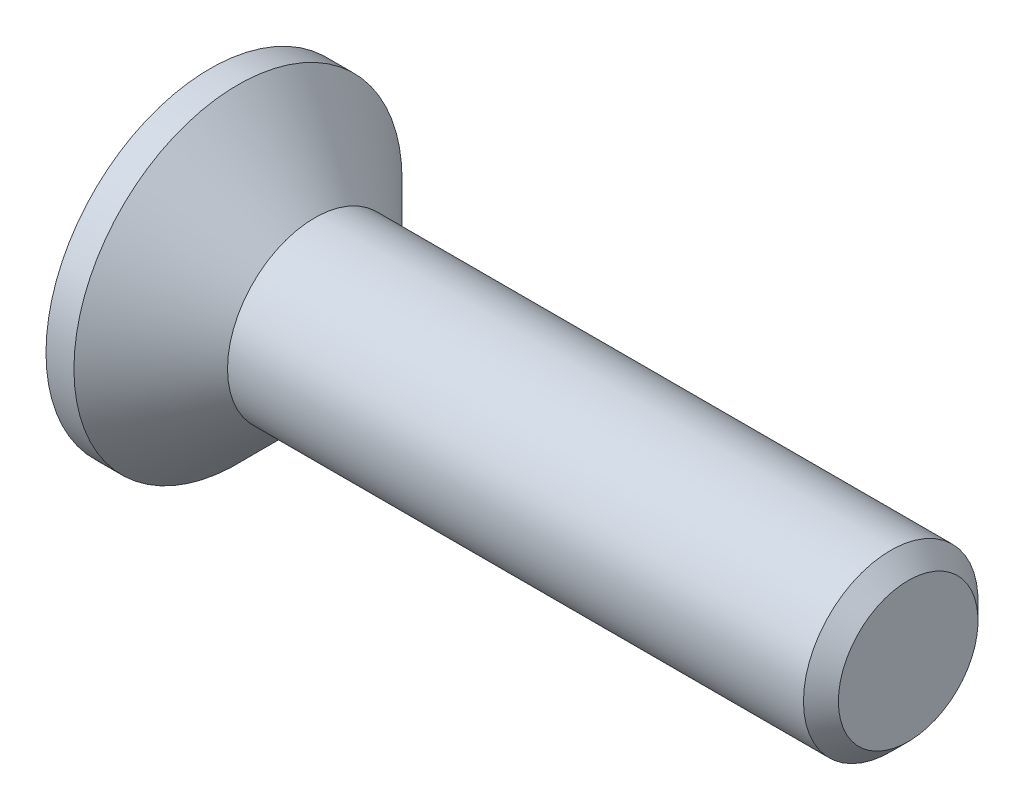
ISO-10303-21;
HEADER;
FILE_DESCRIPTION(('STEP AP214'),'2;1');
FILE_NAME('part.step','',(''),(''),'','','');
FILE_SCHEMA(('AUTOMOTIVE_DESIGN { 1 0 10303 214 1 1 1 1 }'));
ENDSEC;
DATA;
#1=APPLICATION_CONTEXT('core data for automotive mechanical design processes');
#2=APPLICATION_PROTOCOL_DEFINITION('international standard','automotive_design',2000,#1);
#3=PRODUCT_CONTEXT('',#1,'mechanical');
#4=PRODUCT('Part','Part','',(#3));
#5=PRODUCT_RELATED_PRODUCT_CATEGORY('part','',(#4));
#6=PRODUCT_DEFINITION_FORMATION('','',#4);
#7=PRODUCT_DEFINITION_CONTEXT('part definition',#1,'design');
#8=PRODUCT_DEFINITION('design','',#6,#7);
#9=PRODUCT_DEFINITION_SHAPE('','',#8);
#10=(LENGTH_UNIT() NAMED_UNIT(*) SI_UNIT(.MILLI.,.METRE.));
#11=(NAMED_UNIT(*) PLANE_ANGLE_UNIT() SI_UNIT($,.RADIAN.));
#12=(NAMED_UNIT(*) SI_UNIT($,.STERADIAN.) SOLID_ANGLE_UNIT());
#13=UNCERTAINTY_MEASURE_WITH_UNIT(LENGTH_MEASURE(1.E-05),#10,'distance_accuracy_value','');
#14=(GEOMETRIC_REPRESENTATION_CONTEXT(3) GLOBAL_UNCERTAINTY_ASSIGNED_CONTEXT((#13)) GLOBAL_UNIT_ASSIGNED_CONTEXT((#10,
#11,#12)) REPRESENTATION_CONTEXT('',''));
#15=CARTESIAN_POINT('',(0.,0.,0.));
#16=DIRECTION('',(0.,0.,1.));
#17=DIRECTION('',(1.,0.,0.));
#18=AXIS2_PLACEMENT_3D('',#15,#16,#17);
#19=CARTESIAN_POINT('',(0.,0.,0.));
#20=DIRECTION('',(-1.,0.,0.));
#21=DIRECTION('',(0.,0.,1.));
#22=AXIS2_PLACEMENT_3D('',#19,#20,#21);
#23=CONICAL_SURFACE('',#22,1.25,0.78539816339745);
#24=CARTESIAN_POINT('',(-1.1,0.,0.));
#25=DIRECTION('',(-1.,0.,0.));
#26=DIRECTION('',(0.,0.,1.));
#27=AXIS2_PLACEMENT_3D('',#24,#25,#26);
#28=CIRCLE('',#27,2.35);
#29=CARTESIAN_POINT('',(-1.1,0.,2.35));
#30=VERTEX_POINT('',#29);
#31=EDGE_CURVE('E189',#30,#30,#28,.T.);
#32=ORIENTED_EDGE('',*,*,#31,.F.);
#33=EDGE_LOOP('',(#32));
#34=FACE_BOUND('',#33,.T.);
#35=CARTESIAN_POINT('',(0.,0.,0.));
#36=DIRECTION('',(-1.,0.,0.));
#37=DIRECTION('',(0.,0.,1.));
#38=AXIS2_PLACEMENT_3D('',#35,#36,#37);
#39=CIRCLE('',#38,1.25);
#40=CARTESIAN_POINT('',(0.,0.,1.25));
#41=VERTEX_POINT('',#40);
#42=EDGE_CURVE('E212',#41,#41,#39,.T.);
#43=ORIENTED_EDGE('',*,*,#42,.T.);
#44=EDGE_LOOP('',(#43));
#45=FACE_BOUND('',#44,.T.);
#46=ADVANCED_FACE('F33',(#34,#45),#23,.T.);
#47=CARTESIAN_POINT('',(-1.5,0.,0.));
#48=DIRECTION('',(-1.,0.,0.));
#49=DIRECTION('',(0.,0.,1.));
#50=AXIS2_PLACEMENT_3D('',#47,#48,#49);
#51=CYLINDRICAL_SURFACE('',#50,1.25);
#52=CARTESIAN_POINT('',(8.25,0.,0.));
#53=DIRECTION('',(-1.,0.,0.));
#54=DIRECTION('',(0.,0.,1.));
#55=AXIS2_PLACEMENT_3D('',#52,#53,#54);
#56=CIRCLE('',#55,1.25);
#57=CARTESIAN_POINT('',(8.25,0.,1.25));
#58=VERTEX_POINT('',#57);
#59=EDGE_CURVE('E41',#58,#58,#56,.T.);
#60=ORIENTED_EDGE('',*,*,#59,.T.);
#61=EDGE_LOOP('',(#60));
#62=FACE_BOUND('',#61,.T.);
#63=ORIENTED_EDGE('',*,*,#42,.F.);
#64=EDGE_LOOP('',(#63));
#65=FACE_BOUND('',#64,.T.);
#66=ADVANCED_FACE('F217',(#62,#65),#51,.T.);
#67=CARTESIAN_POINT('',(8.5,0.,0.));
#68=DIRECTION('',(-1.,0.,0.));
#69=DIRECTION('',(0.,0.,1.));
#70=AXIS2_PLACEMENT_3D('',#67,#68,#69);
#71=PLANE('',#70);
#72=CARTESIAN_POINT('',(8.5,0.,0.));
#73=DIRECTION('',(-1.,0.,0.));
#74=DIRECTION('',(0.,0.,1.));
#75=AXIS2_PLACEMENT_3D('',#72,#73,#74);
#76=CIRCLE('',#75,0.999999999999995);
#77=CARTESIAN_POINT('',(8.5,0.,0.999999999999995));
#78=VERTEX_POINT('',#77);
#79=EDGE_CURVE('E11',#78,#78,#76,.F.);
#80=ORIENTED_EDGE('',*,*,#79,.T.);
#81=EDGE_LOOP('',(#80));
#82=FACE_BOUND('',#81,.T.);
#83=ADVANCED_FACE('F239',(#82),#71,.F.);
#84=CARTESIAN_POINT('',(-1.5,2.35,0.));
#85=DIRECTION('',(1.,0.,0.));
#86=DIRECTION('',(0.,0.,-1.));
#87=AXIS2_PLACEMENT_3D('',#84,#85,#86);
#88=PLANE('',#87);
#89=DIRECTION('',(0.,0.,-1.));
#90=VECTOR('',#89,1.);
#91=CARTESIAN_POINT('',(-1.5,0.34,-1.35));
#92=LINE('',#91,#90);
#93=CARTESIAN_POINT('',(-1.5,0.34,-0.34));
#94=VERTEX_POINT('',#93);
#95=CARTESIAN_POINT('',(-1.5,0.34,-1.35));
#96=VERTEX_POINT('',#95);
#97=EDGE_CURVE('E158',#94,#96,#92,.T.);
#98=ORIENTED_EDGE('',*,*,#97,.F.);
#99=DIRECTION('',(0.,-1.,0.));
#100=VECTOR('',#99,1.);
#101=CARTESIAN_POINT('',(-1.5,0.34,-0.34));
#102=LINE('',#101,#100);
#103=CARTESIAN_POINT('',(-1.5,1.35,-0.34));
#104=VERTEX_POINT('',#103);
#105=EDGE_CURVE('E48',#104,#94,#102,.T.);
#106=ORIENTED_EDGE('',*,*,#105,.F.);
#107=DIRECTION('',(0.,0.,-1.));
#108=VECTOR('',#107,1.);
#109=CARTESIAN_POINT('',(-1.5,1.35,-0.34));
#110=LINE('',#109,#108);
#111=CARTESIAN_POINT('',(-1.5,1.35,0.34));
#112=VERTEX_POINT('',#111);
#113=EDGE_CURVE('E185',#112,#104,#110,.T.);
#114=ORIENTED_EDGE('',*,*,#113,.F.);
#115=DIRECTION('',(0.,1.,0.));
#116=VECTOR('',#115,1.);
#117=CARTESIAN_POINT('',(-1.5,1.35,0.34));
#118=LINE('',#117,#116);
#119=CARTESIAN_POINT('',(-1.5,0.34,0.34));
#120=VERTEX_POINT('',#119);
#121=EDGE_CURVE('E183',#120,#112,#118,.T.);
#122=ORIENTED_EDGE('',*,*,#121,.F.);
#123=DIRECTION('',(0.,0.,-1.));
#124=VECTOR('',#123,1.);
#125=CARTESIAN_POINT('',(-1.5,0.34,0.34));
#126=LINE('',#125,#124);
#127=CARTESIAN_POINT('',(-1.5,0.34,1.35));
#128=VERTEX_POINT('',#127);
#129=EDGE_CURVE('E132',#128,#120,#126,.T.);
#130=ORIENTED_EDGE('',*,*,#129,.F.);
#131=DIRECTION('',(0.,1.,0.));
#132=VECTOR('',#131,1.);
#133=CARTESIAN_POINT('',(-1.5,0.34,1.35));
#134=LINE('',#133,#132);
#135=CARTESIAN_POINT('',(-1.5,-0.34,1.35));
#136=VERTEX_POINT('',#135);
#137=EDGE_CURVE('E179',#136,#128,#134,.T.);
#138=ORIENTED_EDGE('',*,*,#137,.F.);
#139=DIRECTION('',(0.,0.,1.));
#140=VECTOR('',#139,1.);
#141=CARTESIAN_POINT('',(-1.5,-0.34,1.35));
#142=LINE('',#141,#140);
#143=CARTESIAN_POINT('',(-1.5,-0.34,0.34));
#144=VERTEX_POINT('',#143);
#145=EDGE_CURVE('E176',#144,#136,#142,.T.);
#146=ORIENTED_EDGE('',*,*,#145,.F.);
#147=DIRECTION('',(0.,1.,0.));
#148=VECTOR('',#147,1.);
#149=CARTESIAN_POINT('',(-1.5,-0.34,0.34));
#150=LINE('',#149,#148);
#151=CARTESIAN_POINT('',(-1.5,-1.35,0.34));
#152=VERTEX_POINT('',#151);
#153=EDGE_CURVE('E173',#152,#144,#150,.T.);
#154=ORIENTED_EDGE('',*,*,#153,.F.);
#155=DIRECTION('',(0.,0.,1.));
#156=VECTOR('',#155,1.);
#157=CARTESIAN_POINT('',(-1.5,-1.35,0.34));
#158=LINE('',#157,#156);
#159=CARTESIAN_POINT('',(-1.5,-1.35,-0.34));
#160=VERTEX_POINT('',#159);
#161=EDGE_CURVE('E170',#160,#152,#158,.T.);
#162=ORIENTED_EDGE('',*,*,#161,.F.);
#163=DIRECTION('',(0.,-1.,0.));
#164=VECTOR('',#163,1.);
#165=CARTESIAN_POINT('',(-1.5,-1.35,-0.34));
#166=LINE('',#165,#164);
#167=CARTESIAN_POINT('',(-1.5,-0.34,-0.34));
#168=VERTEX_POINT('',#167);
#169=EDGE_CURVE('E167',#168,#160,#166,.T.);
#170=ORIENTED_EDGE('',*,*,#169,.F.);
#171=DIRECTION('',(0.,0.,1.));
#172=VECTOR('',#171,1.);
#173=CARTESIAN_POINT('',(-1.5,-0.34,-0.34));
#174=LINE('',#173,#172);
#175=CARTESIAN_POINT('',(-1.5,-0.34,-1.35));
#176=VERTEX_POINT('',#175);
#177=EDGE_CURVE('E164',#176,#168,#174,.T.);
#178=ORIENTED_EDGE('',*,*,#177,.F.);
#179=DIRECTION('',(0.,-1.,0.));
#180=VECTOR('',#179,1.);
#181=CARTESIAN_POINT('',(-1.5,-0.34,-1.35));
#182=LINE('',#181,#180);
#183=EDGE_CURVE('E161',#96,#176,#182,.T.);
#184=ORIENTED_EDGE('',*,*,#183,.F.);
#185=EDGE_LOOP('',(#98,#106,#114,#122,#130,#138,#146,#154,#162,#170,#178,#184));
#186=FACE_BOUND('',#185,.T.);
#187=CARTESIAN_POINT('',(-1.5,0.,0.));
#188=DIRECTION('',(-1.,0.,0.));
#189=DIRECTION('',(0.,0.,1.));
#190=AXIS2_PLACEMENT_3D('',#187,#188,#189);
#191=CIRCLE('',#190,2.35);
#192=CARTESIAN_POINT('',(-1.5,0.,2.35));
#193=VERTEX_POINT('',#192);
#194=EDGE_CURVE('E209',#193,#193,#191,.T.);
#195=ORIENTED_EDGE('',*,*,#194,.T.);
#196=EDGE_LOOP('',(#195));
#197=FACE_BOUND('',#196,.T.);
#198=ADVANCED_FACE('F230',(#186,#197),#88,.F.);
#199=CARTESIAN_POINT('',(-1.5,0.,0.));
#200=DIRECTION('',(-1.,0.,0.));
#201=DIRECTION('',(0.,0.,1.));
#202=AXIS2_PLACEMENT_3D('',#199,#200,#201);
#203=CYLINDRICAL_SURFACE('',#202,2.35);
#204=ORIENTED_EDGE('',*,*,#194,.F.);
#205=EDGE_LOOP('',(#204));
#206=FACE_BOUND('',#205,.T.);
#207=ORIENTED_EDGE('',*,*,#31,.T.);
#208=EDGE_LOOP('',(#207));
#209=FACE_BOUND('',#208,.T.);
#210=ADVANCED_FACE('F222',(#206,#209),#203,.T.);
#211=CARTESIAN_POINT('',(8.25,0.,0.));
#212=DIRECTION('',(-1.,0.,0.));
#213=DIRECTION('',(0.,0.,1.));
#214=AXIS2_PLACEMENT_3D('',#211,#212,#213);
#215=CONICAL_SURFACE('',#214,1.25,0.785398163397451);
#216=ORIENTED_EDGE('',*,*,#79,.F.);
#217=EDGE_LOOP('',(#216));
#218=FACE_BOUND('',#217,.T.);
#219=ORIENTED_EDGE('',*,*,#59,.F.);
#220=EDGE_LOOP('',(#219));
#221=FACE_BOUND('',#220,.T.);
#222=ADVANCED_FACE('F35',(#218,#221),#215,.T.);
#223=CARTESIAN_POINT('',(-0.25,0.34,-0.34));
#224=DIRECTION('',(0.,0.,-1.));
#225=DIRECTION('',(-1.,0.,0.));
#226=AXIS2_PLACEMENT_3D('',#223,#224,#225);
#227=PLANE('',#226);
#228=ORIENTED_EDGE('',*,*,#105,.T.);
#229=DIRECTION('',(-1.,0.,0.));
#230=VECTOR('',#229,1.);
#231=CARTESIAN_POINT('',(-0.25,0.34,-0.34));
#232=LINE('',#231,#230);
#233=CARTESIAN_POINT('',(-0.25,0.34,-0.34));
#234=VERTEX_POINT('',#233);
#235=EDGE_CURVE('E96',#234,#94,#232,.T.);
#236=ORIENTED_EDGE('',*,*,#235,.F.);
#237=DIRECTION('',(0.,-1.,0.));
#238=VECTOR('',#237,1.);
#239=CARTESIAN_POINT('',(-0.25,0.34,-0.34));
#240=LINE('',#239,#238);
#241=CARTESIAN_POINT('',(-0.25,1.35,-0.34));
#242=VERTEX_POINT('',#241);
#243=EDGE_CURVE('E187',#242,#234,#240,.T.);
#244=ORIENTED_EDGE('',*,*,#243,.F.);
#245=DIRECTION('',(-1.,0.,0.));
#246=VECTOR('',#245,1.);
#247=CARTESIAN_POINT('',(-0.25,1.35,-0.34));
#248=LINE('',#247,#246);
#249=EDGE_CURVE('E56',#242,#104,#248,.T.);
#250=ORIENTED_EDGE('',*,*,#249,.T.);
#251=EDGE_LOOP('',(#228,#236,#244,#250));
#252=FACE_BOUND('',#251,.T.);
#253=ADVANCED_FACE('F221',(#252),#227,.F.);
#254=CARTESIAN_POINT('',(-0.25,1.35,-0.34));
#255=DIRECTION('',(0.,1.,0.));
#256=DIRECTION('',(-1.,0.,0.));
#257=AXIS2_PLACEMENT_3D('',#254,#255,#256);
#258=PLANE('',#257);
#259=ORIENTED_EDGE('',*,*,#113,.T.);
#260=ORIENTED_EDGE('',*,*,#249,.F.);
#261=DIRECTION('',(0.,0.,-1.));
#262=VECTOR('',#261,1.);
#263=CARTESIAN_POINT('',(-0.25,1.35,-0.34));
#264=LINE('',#263,#262);
#265=CARTESIAN_POINT('',(-0.25,1.35,0.34));
#266=VERTEX_POINT('',#265);
#267=EDGE_CURVE('E144',#266,#242,#264,.T.);
#268=ORIENTED_EDGE('',*,*,#267,.F.);
#269=DIRECTION('',(-1.,0.,0.));
#270=VECTOR('',#269,1.);
#271=CARTESIAN_POINT('',(-0.25,1.35,0.34));
#272=LINE('',#271,#270);
#273=EDGE_CURVE('E136',#266,#112,#272,.T.);
#274=ORIENTED_EDGE('',*,*,#273,.T.);
#275=EDGE_LOOP('',(#259,#260,#268,#274));
#276=FACE_BOUND('',#275,.T.);
#277=ADVANCED_FACE('F228',(#276),#258,.F.);
#278=CARTESIAN_POINT('',(-0.25,1.35,0.34));
#279=DIRECTION('',(0.,0.,1.));
#280=DIRECTION('',(1.,0.,0.));
#281=AXIS2_PLACEMENT_3D('',#278,#279,#280);
#282=PLANE('',#281);
#283=ORIENTED_EDGE('',*,*,#121,.T.);
#284=ORIENTED_EDGE('',*,*,#273,.F.);
#285=DIRECTION('',(0.,1.,0.));
#286=VECTOR('',#285,1.);
#287=CARTESIAN_POINT('',(-0.25,1.35,0.34));
#288=LINE('',#287,#286);
#289=CARTESIAN_POINT('',(-0.25,0.34,0.34));
#290=VERTEX_POINT('',#289);
#291=EDGE_CURVE('E140',#290,#266,#288,.T.);
#292=ORIENTED_EDGE('',*,*,#291,.F.);
#293=DIRECTION('',(-1.,0.,0.));
#294=VECTOR('',#293,1.);
#295=CARTESIAN_POINT('',(-0.25,0.34,0.34));
#296=LINE('',#295,#294);
#297=EDGE_CURVE('E125',#290,#120,#296,.T.);
#298=ORIENTED_EDGE('',*,*,#297,.T.);
#299=EDGE_LOOP('',(#283,#284,#292,#298));
#300=FACE_BOUND('',#299,.T.);
#301=ADVANCED_FACE('F141',(#300),#282,.F.);
#302=CARTESIAN_POINT('',(-0.25,0.34,0.34));
#303=DIRECTION('',(0.,1.,0.));
#304=DIRECTION('',(-1.,0.,0.));
#305=AXIS2_PLACEMENT_3D('',#302,#303,#304);
#306=PLANE('',#305);
#307=ORIENTED_EDGE('',*,*,#129,.T.);
#308=ORIENTED_EDGE('',*,*,#297,.F.);
#309=DIRECTION('',(0.,0.,-1.));
#310=VECTOR('',#309,1.);
#311=CARTESIAN_POINT('',(-0.25,0.34,0.34));
#312=LINE('',#311,#310);
#313=CARTESIAN_POINT('',(-0.25,0.34,1.35));
#314=VERTEX_POINT('',#313);
#315=EDGE_CURVE('E129',#314,#290,#312,.T.);
#316=ORIENTED_EDGE('',*,*,#315,.F.);
#317=DIRECTION('',(-1.,0.,0.));
#318=VECTOR('',#317,1.);
#319=CARTESIAN_POINT('',(-0.25,0.34,1.35));
#320=LINE('',#319,#318);
#321=EDGE_CURVE('E137',#314,#128,#320,.T.);
#322=ORIENTED_EDGE('',*,*,#321,.T.);
#323=EDGE_LOOP('',(#307,#308,#316,#322));
#324=FACE_BOUND('',#323,.T.);
#325=ADVANCED_FACE('F127',(#324),#306,.F.);
#326=CARTESIAN_POINT('',(-0.25,0.34,1.35));
#327=DIRECTION('',(0.,0.,1.));
#328=DIRECTION('',(1.,0.,0.));
#329=AXIS2_PLACEMENT_3D('',#326,#327,#328);
#330=PLANE('',#329);
#331=ORIENTED_EDGE('',*,*,#137,.T.);
#332=ORIENTED_EDGE('',*,*,#321,.F.);
#333=DIRECTION('',(0.,1.,0.));
#334=VECTOR('',#333,1.);
#335=CARTESIAN_POINT('',(-0.25,0.34,1.35));
#336=LINE('',#335,#334);
#337=CARTESIAN_POINT('',(-0.25,-0.34,1.35));
#338=VERTEX_POINT('',#337);
#339=EDGE_CURVE('E150',#338,#314,#336,.T.);
#340=ORIENTED_EDGE('',*,*,#339,.F.);
#341=DIRECTION('',(-1.,0.,0.));
#342=VECTOR('',#341,1.);
#343=CARTESIAN_POINT('',(-0.25,-0.34,1.35));
#344=LINE('',#343,#342);
#345=EDGE_CURVE('E192',#338,#136,#344,.T.);
#346=ORIENTED_EDGE('',*,*,#345,.T.);
#347=EDGE_LOOP('',(#331,#332,#340,#346));
#348=FACE_BOUND('',#347,.T.);
#349=ADVANCED_FACE('F277',(#348),#330,.F.);
#350=CARTESIAN_POINT('',(-0.25,-0.34,1.35));
#351=DIRECTION('',(0.,-1.,0.));
#352=DIRECTION('',(1.,0.,0.));
#353=AXIS2_PLACEMENT_3D('',#350,#351,#352);
#354=PLANE('',#353);
#355=ORIENTED_EDGE('',*,*,#145,.T.);
#356=ORIENTED_EDGE('',*,*,#345,.F.);
#357=DIRECTION('',(0.,0.,1.));
#358=VECTOR('',#357,1.);
#359=CARTESIAN_POINT('',(-0.25,-0.34,1.35));
#360=LINE('',#359,#358);
#361=CARTESIAN_POINT('',(-0.25,-0.34,0.34));
#362=VERTEX_POINT('',#361);
#363=EDGE_CURVE('E152',#362,#338,#360,.T.);
#364=ORIENTED_EDGE('',*,*,#363,.F.);
#365=DIRECTION('',(-1.,0.,0.));
#366=VECTOR('',#365,1.);
#367=CARTESIAN_POINT('',(-0.25,-0.34,0.34));
#368=LINE('',#367,#366);
#369=EDGE_CURVE('E194',#362,#144,#368,.T.);
#370=ORIENTED_EDGE('',*,*,#369,.T.);
#371=EDGE_LOOP('',(#355,#356,#364,#370));
#372=FACE_BOUND('',#371,.T.);
#373=ADVANCED_FACE('F273',(#372),#354,.F.);
#374=CARTESIAN_POINT('',(-0.25,-0.34,0.34));
#375=DIRECTION('',(0.,0.,1.));
#376=DIRECTION('',(1.,0.,0.));
#377=AXIS2_PLACEMENT_3D('',#374,#375,#376);
#378=PLANE('',#377);
#379=ORIENTED_EDGE('',*,*,#153,.T.);
#380=ORIENTED_EDGE('',*,*,#369,.F.);
#381=DIRECTION('',(0.,1.,0.));
#382=VECTOR('',#381,1.);
#383=CARTESIAN_POINT('',(-0.25,-0.34,0.34));
#384=LINE('',#383,#382);
#385=CARTESIAN_POINT('',(-0.25,-1.35,0.34));
#386=VERTEX_POINT('',#385);
#387=EDGE_CURVE('E422',#386,#362,#384,.T.);
#388=ORIENTED_EDGE('',*,*,#387,.F.);
#389=DIRECTION('',(-1.,0.,0.));
#390=VECTOR('',#389,1.);
#391=CARTESIAN_POINT('',(-0.25,-1.35,0.34));
#392=LINE('',#391,#390);
#393=EDGE_CURVE('E196',#386,#152,#392,.T.);
#394=ORIENTED_EDGE('',*,*,#393,.T.);
#395=EDGE_LOOP('',(#379,#380,#388,#394));
#396=FACE_BOUND('',#395,.T.);
#397=ADVANCED_FACE('F269',(#396),#378,.F.);
#398=CARTESIAN_POINT('',(-0.25,-1.35,0.34));
#399=DIRECTION('',(0.,-1.,0.));
#400=DIRECTION('',(1.,0.,0.));
#401=AXIS2_PLACEMENT_3D('',#398,#399,#400);
#402=PLANE('',#401);
#403=ORIENTED_EDGE('',*,*,#161,.T.);
#404=ORIENTED_EDGE('',*,*,#393,.F.);
#405=DIRECTION('',(0.,0.,1.));
#406=VECTOR('',#405,1.);
#407=CARTESIAN_POINT('',(-0.25,-1.35,0.34));
#408=LINE('',#407,#406);
#409=CARTESIAN_POINT('',(-0.25,-1.35,-0.34));
#410=VERTEX_POINT('',#409);
#411=EDGE_CURVE('E419',#410,#386,#408,.T.);
#412=ORIENTED_EDGE('',*,*,#411,.F.);
#413=DIRECTION('',(-1.,0.,0.));
#414=VECTOR('',#413,1.);
#415=CARTESIAN_POINT('',(-0.25,-1.35,-0.34));
#416=LINE('',#415,#414);
#417=EDGE_CURVE('E198',#410,#160,#416,.T.);
#418=ORIENTED_EDGE('',*,*,#417,.T.);
#419=EDGE_LOOP('',(#403,#404,#412,#418));
#420=FACE_BOUND('',#419,.T.);
#421=ADVANCED_FACE('F265',(#420),#402,.F.);
#422=CARTESIAN_POINT('',(-0.25,-1.35,-0.34));
#423=DIRECTION('',(0.,0.,-1.));
#424=DIRECTION('',(-1.,0.,0.));
#425=AXIS2_PLACEMENT_3D('',#422,#423,#424);
#426=PLANE('',#425);
#427=ORIENTED_EDGE('',*,*,#169,.T.);
#428=ORIENTED_EDGE('',*,*,#417,.F.);
#429=DIRECTION('',(0.,-1.,0.));
#430=VECTOR('',#429,1.);
#431=CARTESIAN_POINT('',(-0.25,-1.35,-0.34));
#432=LINE('',#431,#430);
#433=CARTESIAN_POINT('',(-0.25,-0.34,-0.34));
#434=VERTEX_POINT('',#433);
#435=EDGE_CURVE('E416',#434,#410,#432,.T.);
#436=ORIENTED_EDGE('',*,*,#435,.F.);
#437=DIRECTION('',(-1.,0.,0.));
#438=VECTOR('',#437,1.);
#439=CARTESIAN_POINT('',(-0.25,-0.34,-0.34));
#440=LINE('',#439,#438);
#441=EDGE_CURVE('E200',#434,#168,#440,.T.);
#442=ORIENTED_EDGE('',*,*,#441,.T.);
#443=EDGE_LOOP('',(#427,#428,#436,#442));
#444=FACE_BOUND('',#443,.T.);
#445=ADVANCED_FACE('F261',(#444),#426,.F.);
#446=CARTESIAN_POINT('',(-0.25,-0.34,-0.34));
#447=DIRECTION('',(0.,-1.,0.));
#448=DIRECTION('',(1.,0.,0.));
#449=AXIS2_PLACEMENT_3D('',#446,#447,#448);
#450=PLANE('',#449);
#451=ORIENTED_EDGE('',*,*,#177,.T.);
#452=ORIENTED_EDGE('',*,*,#441,.F.);
#453=DIRECTION('',(0.,0.,1.));
#454=VECTOR('',#453,1.);
#455=CARTESIAN_POINT('',(-0.25,-0.34,-0.34));
#456=LINE('',#455,#454);
#457=CARTESIAN_POINT('',(-0.25,-0.34,-1.35));
#458=VERTEX_POINT('',#457);
#459=EDGE_CURVE('E413',#458,#434,#456,.T.);
#460=ORIENTED_EDGE('',*,*,#459,.F.);
#461=DIRECTION('',(-1.,0.,0.));
#462=VECTOR('',#461,1.);
#463=CARTESIAN_POINT('',(-0.25,-0.34,-1.35));
#464=LINE('',#463,#462);
#465=EDGE_CURVE('E202',#458,#176,#464,.T.);
#466=ORIENTED_EDGE('',*,*,#465,.T.);
#467=EDGE_LOOP('',(#451,#452,#460,#466));
#468=FACE_BOUND('',#467,.T.);
#469=ADVANCED_FACE('F257',(#468),#450,.F.);
#470=CARTESIAN_POINT('',(-0.25,-0.34,-1.35));
#471=DIRECTION('',(0.,0.,-1.));
#472=DIRECTION('',(-1.,0.,0.));
#473=AXIS2_PLACEMENT_3D('',#470,#471,#472);
#474=PLANE('',#473);
#475=ORIENTED_EDGE('',*,*,#183,.T.);
#476=ORIENTED_EDGE('',*,*,#465,.F.);
#477=DIRECTION('',(0.,-1.,0.));
#478=VECTOR('',#477,1.);
#479=CARTESIAN_POINT('',(-0.25,-0.34,-1.35));
#480=LINE('',#479,#478);
#481=CARTESIAN_POINT('',(-0.25,0.34,-1.35));
#482=VERTEX_POINT('',#481);
#483=EDGE_CURVE('E408',#482,#458,#480,.T.);
#484=ORIENTED_EDGE('',*,*,#483,.F.);
#485=DIRECTION('',(-1.,0.,0.));
#486=VECTOR('',#485,1.);
#487=CARTESIAN_POINT('',(-0.25,0.34,-1.35));
#488=LINE('',#487,#486);
#489=EDGE_CURVE('E204',#482,#96,#488,.T.);
#490=ORIENTED_EDGE('',*,*,#489,.T.);
#491=EDGE_LOOP('',(#475,#476,#484,#490));
#492=FACE_BOUND('',#491,.T.);
#493=ADVANCED_FACE('F253',(#492),#474,.F.);
#494=CARTESIAN_POINT('',(-0.25,0.34,-1.35));
#495=DIRECTION('',(0.,1.,0.));
#496=DIRECTION('',(-1.,0.,0.));
#497=AXIS2_PLACEMENT_3D('',#494,#495,#496);
#498=PLANE('',#497);
#499=ORIENTED_EDGE('',*,*,#97,.T.);
#500=ORIENTED_EDGE('',*,*,#489,.F.);
#501=DIRECTION('',(0.,0.,-1.));
#502=VECTOR('',#501,1.);
#503=CARTESIAN_POINT('',(-0.25,0.34,-1.35));
#504=LINE('',#503,#502);
#505=EDGE_CURVE('E406',#234,#482,#504,.T.);
#506=ORIENTED_EDGE('',*,*,#505,.F.);
#507=ORIENTED_EDGE('',*,*,#235,.T.);
#508=EDGE_LOOP('',(#499,#500,#506,#507));
#509=FACE_BOUND('',#508,.T.);
#510=ADVANCED_FACE('F250',(#509),#498,.F.);
#511=CARTESIAN_POINT('',(-0.25,0.,0.));
#512=DIRECTION('',(1.,0.,0.));
#513=DIRECTION('',(0.,0.,-1.));
#514=AXIS2_PLACEMENT_3D('',#511,#512,#513);
#515=PLANE('',#514);
#516=ORIENTED_EDGE('',*,*,#243,.T.);
#517=ORIENTED_EDGE('',*,*,#505,.T.);
#518=ORIENTED_EDGE('',*,*,#483,.T.);
#519=ORIENTED_EDGE('',*,*,#459,.T.);
#520=ORIENTED_EDGE('',*,*,#435,.T.);
#521=ORIENTED_EDGE('',*,*,#411,.T.);
#522=ORIENTED_EDGE('',*,*,#387,.T.);
#523=ORIENTED_EDGE('',*,*,#363,.T.);
#524=ORIENTED_EDGE('',*,*,#339,.T.);
#525=ORIENTED_EDGE('',*,*,#315,.T.);
#526=ORIENTED_EDGE('',*,*,#291,.T.);
#527=ORIENTED_EDGE('',*,*,#267,.T.);
#528=EDGE_LOOP('',(#516,#517,#518,#519,#520,#521,#522,#523,#524,#525,#526,#527));
#529=FACE_BOUND('',#528,.T.);
#530=ADVANCED_FACE('F147',(#529),#515,.F.);
#531=CLOSED_SHELL('',(#46,#66,#83,#198,#210,#222,#253,#277,#301,#325,#349,#373,#397,#421,#445,
#469,#493,#510,#530));
#532=MANIFOLD_SOLID_BREP('B2',#531);
#533=ADVANCED_BREP_SHAPE_REPRESENTATION('',(#18,#532),#14);
#534=SHAPE_DEFINITION_REPRESENTATION(#9,#533);
ENDSEC;
END-ISO-10303-21;
